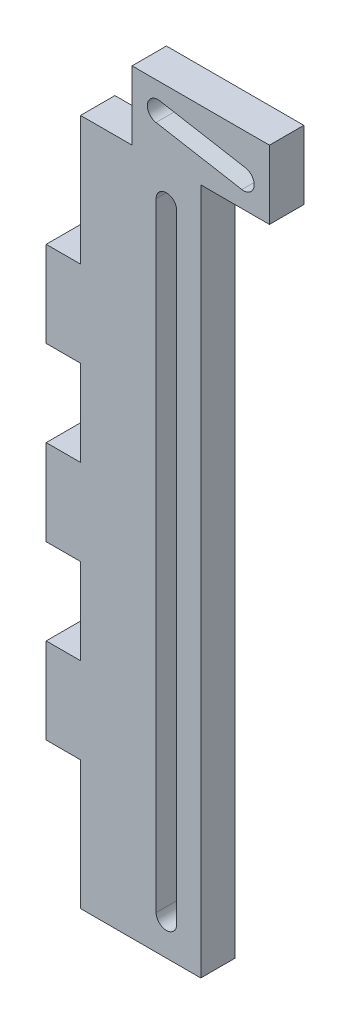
from build123d import *

# Parameters (mm, degrees)
BOSS_EXTRUDE1_DEPTH = 2


with BuildPart() as part:
    # Sketch2 → Boss-Extrude1 (new body)
    with BuildSketch(Plane.XY):
        Polygon((0, 0), (7, 0), (7, 40), (11, 40), (11, 44), (3, 44), (3, 40), (0, 40), (0, 32.5), (-2, 32.5), (-2, 27.5), (0, 27.5), (0, 22.5), (-2, 22.5), (-2, 17.5), (0, 17.5), (0, 12.5), (-2, 12.5), (-2, 7.5), (0, 7.5), align=None)
        with BuildLine():
            Line((5.6, 38), (5.6, 2))
            ThreePointArc((5.6, 2), (5, 1.4), (4.4, 2))
            Line((4.4, 2), (4.4, 38))
            ThreePointArc((4.4, 38), (5, 38.6), (5.6, 38))
        make_face(mode=Mode.SUBTRACT)
        with BuildLine():
            Line((4.605925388, 43.041550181), (9.605925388, 42.159915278))
            ThreePointArc((9.605925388, 42.159915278), (10.100732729, 41.45325716), (9.394074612, 40.958449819))
            Line((9.394074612, 40.958449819), (4.394074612, 41.840084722))
            ThreePointArc((4.394074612, 41.840084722), (3.899267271, 42.54674284), (4.605925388, 43.041550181))
        make_face(mode=Mode.SUBTRACT)
    extrude(amount=BOSS_EXTRUDE1_DEPTH)


solid = part.part
